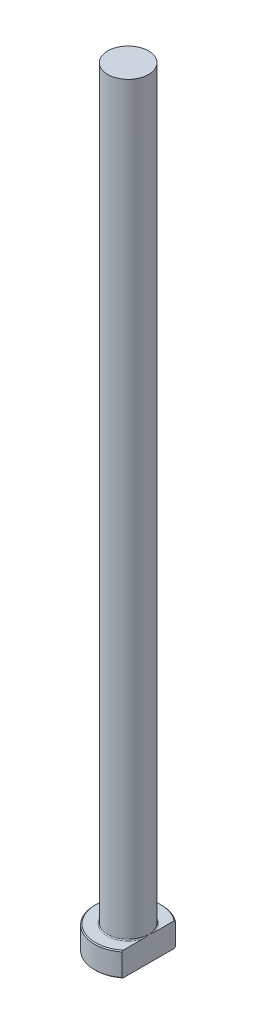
ISO-10303-21;
HEADER;
FILE_DESCRIPTION(('STEP AP214'),'2;1');
FILE_NAME('part.step','',(''),(''),'','','');
FILE_SCHEMA(('AUTOMOTIVE_DESIGN { 1 0 10303 214 1 1 1 1 }'));
ENDSEC;
DATA;
#1=APPLICATION_CONTEXT('core data for automotive mechanical design processes');
#2=APPLICATION_PROTOCOL_DEFINITION('international standard','automotive_design',2000,#1);
#3=PRODUCT_CONTEXT('',#1,'mechanical');
#4=PRODUCT('Part','Part','',(#3));
#5=PRODUCT_RELATED_PRODUCT_CATEGORY('part','',(#4));
#6=PRODUCT_DEFINITION_FORMATION('','',#4);
#7=PRODUCT_DEFINITION_CONTEXT('part definition',#1,'design');
#8=PRODUCT_DEFINITION('design','',#6,#7);
#9=PRODUCT_DEFINITION_SHAPE('','',#8);
#10=(LENGTH_UNIT() NAMED_UNIT(*) SI_UNIT(.MILLI.,.METRE.));
#11=(NAMED_UNIT(*) PLANE_ANGLE_UNIT() SI_UNIT($,.RADIAN.));
#12=(NAMED_UNIT(*) SI_UNIT($,.STERADIAN.) SOLID_ANGLE_UNIT());
#13=UNCERTAINTY_MEASURE_WITH_UNIT(LENGTH_MEASURE(1.E-05),#10,'distance_accuracy_value','');
#14=(GEOMETRIC_REPRESENTATION_CONTEXT(3) GLOBAL_UNCERTAINTY_ASSIGNED_CONTEXT((#13)) GLOBAL_UNIT_ASSIGNED_CONTEXT((#10,
#11,#12)) REPRESENTATION_CONTEXT('',''));
#15=CARTESIAN_POINT('',(0.,0.,0.));
#16=DIRECTION('',(0.,0.,1.));
#17=DIRECTION('',(1.,0.,0.));
#18=AXIS2_PLACEMENT_3D('',#15,#16,#17);
#19=CARTESIAN_POINT('',(0.,0.,0.));
#20=DIRECTION('',(0.,-1.,0.));
#21=DIRECTION('',(0.,0.,-1.));
#22=AXIS2_PLACEMENT_3D('',#19,#20,#21);
#23=PLANE('',#22);
#24=CARTESIAN_POINT('',(0.,0.,0.));
#25=DIRECTION('',(0.,-1.,0.));
#26=DIRECTION('',(0.,0.,-1.));
#27=AXIS2_PLACEMENT_3D('',#24,#25,#26);
#28=CIRCLE('',#27,6.79999999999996);
#29=CARTESIAN_POINT('',(4.24999999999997,0.,5.30824829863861));
#30=VERTEX_POINT('',#29);
#31=CARTESIAN_POINT('',(4.24999999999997,0.,-5.30824829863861));
#32=VERTEX_POINT('',#31);
#33=EDGE_CURVE('E98',#30,#32,#28,.T.);
#34=ORIENTED_EDGE('',*,*,#33,.T.);
#35=DIRECTION('',(0.,0.,1.));
#36=VECTOR('',#35,1.);
#37=CARTESIAN_POINT('',(4.24999999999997,0.,-5.56214886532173));
#38=LINE('',#37,#36);
#39=EDGE_CURVE('E83',#32,#30,#38,.T.);
#40=ORIENTED_EDGE('',*,*,#39,.T.);
#41=EDGE_LOOP('',(#34,#40));
#42=FACE_BOUND('',#41,.T.);
#43=ADVANCED_FACE('F32',(#42),#23,.T.);
#44=CARTESIAN_POINT('',(0.,259.958771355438,0.));
#45=DIRECTION('',(0.,1.,0.));
#46=DIRECTION('',(0.,0.,1.));
#47=AXIS2_PLACEMENT_3D('',#44,#45,#46);
#48=CYLINDRICAL_SURFACE('',#47,6.99999999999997);
#49=CARTESIAN_POINT('',(0.,4.80000000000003,0.));
#50=DIRECTION('',(0.,1.,0.));
#51=DIRECTION('',(0.,0.,1.));
#52=AXIS2_PLACEMENT_3D('',#49,#50,#51);
#53=CIRCLE('',#52,6.99999999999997);
#54=CARTESIAN_POINT('',(4.24999999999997,4.80000000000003,5.56214886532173));
#55=VERTEX_POINT('',#54);
#56=CARTESIAN_POINT('',(4.24999999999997,4.80000000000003,-5.56214886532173));
#57=VERTEX_POINT('',#56);
#58=EDGE_CURVE('E104',#55,#57,#53,.F.);
#59=ORIENTED_EDGE('',*,*,#58,.T.);
#60=DIRECTION('',(0.,-1.,0.));
#61=VECTOR('',#60,1.);
#62=CARTESIAN_POINT('',(4.24999999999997,160.,-5.56214886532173));
#63=LINE('',#62,#61);
#64=CARTESIAN_POINT('',(4.24999999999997,0.200000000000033,-5.56214886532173));
#65=VERTEX_POINT('',#64);
#66=EDGE_CURVE('E183',#57,#65,#63,.T.);
#67=ORIENTED_EDGE('',*,*,#66,.T.);
#68=CARTESIAN_POINT('',(0.,0.200000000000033,0.));
#69=DIRECTION('',(0.,-1.,0.));
#70=DIRECTION('',(0.,0.,-1.));
#71=AXIS2_PLACEMENT_3D('',#68,#69,#70);
#72=CIRCLE('',#71,6.99999999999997);
#73=CARTESIAN_POINT('',(4.24999999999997,0.200000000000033,5.56214886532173));
#74=VERTEX_POINT('',#73);
#75=EDGE_CURVE('E100',#65,#74,#72,.F.);
#76=ORIENTED_EDGE('',*,*,#75,.T.);
#77=DIRECTION('',(0.,-1.,0.));
#78=VECTOR('',#77,1.);
#79=CARTESIAN_POINT('',(4.24999999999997,160.,5.56214886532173));
#80=LINE('',#79,#78);
#81=EDGE_CURVE('E93',#55,#74,#80,.T.);
#82=ORIENTED_EDGE('',*,*,#81,.F.);
#83=EDGE_LOOP('',(#59,#67,#76,#82));
#84=FACE_BOUND('',#83,.T.);
#85=ADVANCED_FACE('F158',(#84),#48,.T.);
#86=CARTESIAN_POINT('',(-6.99999999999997,5.,0.));
#87=DIRECTION('',(0.,1.,0.));
#88=DIRECTION('',(0.,0.,1.));
#89=AXIS2_PLACEMENT_3D('',#86,#87,#88);
#90=PLANE('',#89);
#91=CARTESIAN_POINT('',(0.,5.,0.));
#92=DIRECTION('',(0.,1.,0.));
#93=DIRECTION('',(0.,0.,1.));
#94=AXIS2_PLACEMENT_3D('',#91,#92,#93);
#95=CIRCLE('',#94,6.80000000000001);
#96=CARTESIAN_POINT('',(4.24999999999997,5.,-5.30824829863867));
#97=VERTEX_POINT('',#96);
#98=CARTESIAN_POINT('',(4.24999999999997,5.,5.30824829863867));
#99=VERTEX_POINT('',#98);
#100=EDGE_CURVE('E178',#97,#99,#95,.T.);
#101=ORIENTED_EDGE('',*,*,#100,.T.);
#102=DIRECTION('',(0.,0.,-1.));
#103=VECTOR('',#102,1.);
#104=CARTESIAN_POINT('',(4.24999999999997,5.,0.));
#105=LINE('',#104,#103);
#106=CARTESIAN_POINT('',(4.24999999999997,4.99999999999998,1.31909059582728));
#107=VERTEX_POINT('',#106);
#108=EDGE_CURVE('E57',#99,#107,#105,.T.);
#109=ORIENTED_EDGE('',*,*,#108,.T.);
#110=CARTESIAN_POINT('',(0.,5.,0.));
#111=DIRECTION('',(0.,1.,0.));
#112=DIRECTION('',(0.,0.,1.));
#113=AXIS2_PLACEMENT_3D('',#110,#111,#112);
#114=CIRCLE('',#113,4.44999999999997);
#115=CARTESIAN_POINT('',(4.24999999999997,4.99999999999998,-1.31909059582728));
#116=VERTEX_POINT('',#115);
#117=EDGE_CURVE('E107',#107,#116,#114,.F.);
#118=ORIENTED_EDGE('',*,*,#117,.T.);
#119=EDGE_CURVE('E136',#116,#97,#105,.T.);
#120=ORIENTED_EDGE('',*,*,#119,.T.);
#121=EDGE_LOOP('',(#101,#109,#118,#120));
#122=FACE_BOUND('',#121,.T.);
#123=ADVANCED_FACE('F147',(#122),#90,.T.);
#124=CARTESIAN_POINT('',(0.,5.,0.));
#125=DIRECTION('',(0.,-1.,0.));
#126=DIRECTION('',(0.,0.,-1.));
#127=AXIS2_PLACEMENT_3D('',#124,#125,#126);
#128=CONICAL_SURFACE('',#127,6.8,0.785398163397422);
#129=ORIENTED_EDGE('',*,*,#58,.F.);
#130=CARTESIAN_POINT('',(4.24999999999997,-1.15497179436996,12.2380061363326));
#131=CARTESIAN_POINT('',(4.24999999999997,-0.968600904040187,12.0407126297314));
#132=CARTESIAN_POINT('',(4.24999999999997,-0.782481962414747,11.843180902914));
#133=CARTESIAN_POINT('',(4.24999999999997,-0.41083559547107,11.4475596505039));
#134=CARTESIAN_POINT('',(4.24999999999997,-0.225308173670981,11.2494701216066));
#135=CARTESIAN_POINT('',(4.24999999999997,0.330615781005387,10.6538566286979));
#136=CARTESIAN_POINT('',(4.24999999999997,0.699987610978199,10.2553749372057));
#137=CARTESIAN_POINT('',(4.24999999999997,1.44820689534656,9.44056382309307));
#138=CARTESIAN_POINT('',(4.24999999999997,1.82691721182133,9.02410803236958));
#139=CARTESIAN_POINT('',(4.24999999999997,2.39038838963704,8.39564122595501));
#140=CARTESIAN_POINT('',(4.24999999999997,2.57736390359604,8.18561642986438));
#141=CARTESIAN_POINT('',(4.24999999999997,2.94948531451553,7.76395344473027));
#142=CARTESIAN_POINT('',(4.24999999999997,3.13463122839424,7.55231527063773));
#143=CARTESIAN_POINT('',(4.24999999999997,3.50243810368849,7.12729701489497));
#144=CARTESIAN_POINT('',(4.24999999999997,3.68510158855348,6.91391912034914));
#145=CARTESIAN_POINT('',(4.24999999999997,4.04753998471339,6.48470257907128));
#146=CARTESIAN_POINT('',(4.24999999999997,4.227314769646,6.26886382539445));
#147=CARTESIAN_POINT('',(4.24999999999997,4.58362310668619,5.83346482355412));
#148=CARTESIAN_POINT('',(4.24999999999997,4.76014565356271,5.61389554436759));
#149=CARTESIAN_POINT('',(4.24999999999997,5.10813954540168,5.17081545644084));
#150=CARTESIAN_POINT('',(4.24999999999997,5.27961153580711,4.94730515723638));
#151=CARTESIAN_POINT('',(4.24999999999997,5.61292794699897,4.49883470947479));
#152=CARTESIAN_POINT('',(4.24999999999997,5.77488381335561,4.2739577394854));
#153=CARTESIAN_POINT('',(4.24999999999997,6.08959034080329,3.8175542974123));
#154=CARTESIAN_POINT('',(4.24999999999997,6.24233528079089,3.58602382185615));
#155=CARTESIAN_POINT('',(4.24999999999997,6.46088242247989,3.23296927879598));
#156=CARTESIAN_POINT('',(4.24999999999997,6.5318099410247,3.11461948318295));
#157=CARTESIAN_POINT('',(4.24999999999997,6.66953191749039,2.87554671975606));
#158=CARTESIAN_POINT('',(4.24999999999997,6.73632692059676,2.75482406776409));
#159=CARTESIAN_POINT('',(4.24999999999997,6.8648005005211,2.51086229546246));
#160=CARTESIAN_POINT('',(4.24999999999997,6.92648531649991,2.38762647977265));
#161=CARTESIAN_POINT('',(4.24999999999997,7.04367856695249,2.13827051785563));
#162=CARTESIAN_POINT('',(4.24999999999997,7.09918867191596,2.0121511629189));
#163=CARTESIAN_POINT('',(4.24999999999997,7.20212054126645,1.75821381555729));
#164=CARTESIAN_POINT('',(4.24999999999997,7.24962333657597,1.63042897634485));
#165=CARTESIAN_POINT('',(4.24999999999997,7.33574687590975,1.37182854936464));
#166=CARTESIAN_POINT('',(4.24999999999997,7.37436534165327,1.24101219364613));
#167=CARTESIAN_POINT('',(4.24999999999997,7.44090399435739,0.977431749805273));
#168=CARTESIAN_POINT('',(4.24999999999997,7.46888314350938,0.844682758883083));
#169=CARTESIAN_POINT('',(4.24999999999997,7.513008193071,0.577216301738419));
#170=CARTESIAN_POINT('',(4.24999999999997,7.52915548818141,0.44249906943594));
#171=CARTESIAN_POINT('',(4.24999999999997,7.54874331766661,0.170860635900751));
#172=CARTESIAN_POINT('',(4.24999999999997,7.55206380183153,0.0339306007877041));
#173=CARTESIAN_POINT('',(4.24999999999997,7.54544836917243,-0.239598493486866));
#174=CARTESIAN_POINT('',(4.24999999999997,7.53551276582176,-0.376197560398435));
#175=CARTESIAN_POINT('',(4.24999999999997,7.50295253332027,-0.648437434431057));
#176=CARTESIAN_POINT('',(4.24999999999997,7.48027427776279,-0.784071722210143));
#177=CARTESIAN_POINT('',(4.24999999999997,7.42348982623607,-1.05291460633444));
#178=CARTESIAN_POINT('',(4.24999999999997,7.38938084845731,-1.18612260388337));
#179=CARTESIAN_POINT('',(4.24999999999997,7.29188531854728,-1.51531404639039));
#180=CARTESIAN_POINT('',(4.24999999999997,7.22238075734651,-1.70947814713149));
#181=CARTESIAN_POINT('',(4.24999999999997,7.06668741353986,-2.09097599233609));
#182=CARTESIAN_POINT('',(4.24999999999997,6.98048657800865,-2.27830468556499));
#183=CARTESIAN_POINT('',(4.24999999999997,6.8414947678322,-2.55552751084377));
#184=CARTESIAN_POINT('',(4.24999999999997,6.79327931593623,-2.64776502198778));
#185=CARTESIAN_POINT('',(4.24999999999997,6.69413480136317,-2.83077431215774));
#186=CARTESIAN_POINT('',(4.24999999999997,6.64320570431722,-2.92154607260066));
#187=CARTESIAN_POINT('',(4.24999999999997,6.53904474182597,-3.10170103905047));
#188=CARTESIAN_POINT('',(4.24999999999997,6.48581387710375,-3.1910848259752));
#189=CARTESIAN_POINT('',(4.24999999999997,6.37734720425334,-3.368618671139));
#190=CARTESIAN_POINT('',(4.24999999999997,6.32211148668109,-3.45676878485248));
#191=CARTESIAN_POINT('',(4.24999999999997,6.13027123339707,-3.75631659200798));
#192=CARTESIAN_POINT('',(4.24999999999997,5.98947006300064,-3.96503082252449));
#193=CARTESIAN_POINT('',(4.24999999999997,5.70061349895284,-4.37739745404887));
#194=CARTESIAN_POINT('',(4.24999999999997,5.55255625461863,-4.58104854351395));
#195=CARTESIAN_POINT('',(4.24999999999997,5.25096308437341,-4.98451036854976));
#196=CARTESIAN_POINT('',(4.24999999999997,5.09742258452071,-5.1843176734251));
#197=CARTESIAN_POINT('',(4.24999999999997,4.78630665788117,-5.58072220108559));
#198=CARTESIAN_POINT('',(4.24999999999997,4.62873161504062,-5.77731972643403));
#199=CARTESIAN_POINT('',(4.24999999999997,4.30987074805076,-6.1686662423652));
#200=CARTESIAN_POINT('',(4.24999999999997,4.14857352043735,-6.36340591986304));
#201=CARTESIAN_POINT('',(4.24999999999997,3.82349048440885,-6.75079948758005));
#202=CARTESIAN_POINT('',(4.24999999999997,3.65970462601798,-6.94345333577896));
#203=CARTESIAN_POINT('',(4.24999999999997,3.33022176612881,-7.32695469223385));
#204=CARTESIAN_POINT('',(4.24999999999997,3.16452573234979,-7.51780303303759));
#205=CARTESIAN_POINT('',(4.24999999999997,2.83151234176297,-7.89808083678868));
#206=CARTESIAN_POINT('',(4.24999999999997,2.66419497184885,-8.08751028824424));
#207=CARTESIAN_POINT('',(4.24999999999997,2.1967456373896,-8.61299836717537));
#208=CARTESIAN_POINT('',(4.24999999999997,1.89516668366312,-8.94776953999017));
#209=CARTESIAN_POINT('',(4.24999999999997,1.28890266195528,-9.6145639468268));
#210=CARTESIAN_POINT('',(4.24999999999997,0.984217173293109,-9.94658679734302));
#211=CARTESIAN_POINT('',(4.24999999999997,0.374739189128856,-10.6061264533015));
#212=CARTESIAN_POINT('',(4.24999999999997,0.0699631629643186,-10.9336584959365));
#213=CARTESIAN_POINT('',(4.24999999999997,-0.541317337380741,-11.5870007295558));
#214=CARTESIAN_POINT('',(4.24999999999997,-0.847821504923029,-11.9128112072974));
#215=CARTESIAN_POINT('',(4.24999999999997,-1.15497179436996,-12.2380061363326));
#216=B_SPLINE_CURVE_WITH_KNOTS('',3,(#130,#131,#132,#133,#134,#135,#136,#137,#138,#139,#140,
#141,#142,#143,#144,#145,#146,#147,#148,#149,#150,#151,#152,#153,#154,#155,#156,#157,#158,#159,
#160,#161,#162,#163,#164,#165,#166,#167,#168,#169,#170,#171,#172,#173,#174,#175,#176,#177,#178,
#179,#180,#181,#182,#183,#184,#185,#186,#187,#188,#189,#190,#191,#192,#193,#194,#195,#196,#197,
#198,#199,#200,#201,#202,#203,#204,#205,#206,#207,#208,#209,#210,#211,#212,#213,#214,#215),
.UNSPECIFIED.,.F.,.F.,(4,2,2,2,2,2,2,2,2,2,2,2,2,2,2,2,2,2,2,2,2,2,2,2,2,2,2,2,2,2,2,2,2,2,2,2,
2,2,2,2,2,2,4),(0.,0.814204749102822,1.62841433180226,3.25843263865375,4.94708916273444,
5.79066412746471,6.63423128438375,7.47686481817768,8.31953511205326,9.16466757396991,
10.0096915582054,10.8409260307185,11.6726715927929,12.0865355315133,12.500344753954,
12.9136410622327,13.3268252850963,13.7355380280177,14.1443554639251,14.5508730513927,
14.9573427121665,15.3676075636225,15.777862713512,16.1898574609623,16.6019525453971,
17.2195383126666,17.8375715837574,18.1497730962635,18.461978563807,18.7740496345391,
19.0861066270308,19.8411596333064,20.5964062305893,21.3522982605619,22.1081186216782,
22.8666854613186,23.6252675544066,24.3834808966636,25.141700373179,26.4934084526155,
27.845302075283,29.1874909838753,30.5294487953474),.UNSPECIFIED.);
#217=EDGE_CURVE('E135',#55,#99,#216,.T.);
#218=ORIENTED_EDGE('',*,*,#217,.T.);
#219=ORIENTED_EDGE('',*,*,#100,.F.);
#220=EDGE_CURVE('E127',#97,#57,#216,.T.);
#221=ORIENTED_EDGE('',*,*,#220,.T.);
#222=EDGE_LOOP('',(#129,#218,#219,#221));
#223=FACE_BOUND('',#222,.T.);
#224=ADVANCED_FACE('F143',(#223),#128,.T.);
#225=CARTESIAN_POINT('',(0.,0.200000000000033,0.));
#226=DIRECTION('',(0.,1.,0.));
#227=DIRECTION('',(0.,0.,1.));
#228=AXIS2_PLACEMENT_3D('',#225,#226,#227);
#229=CONICAL_SURFACE('',#228,6.99999999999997,0.785398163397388);
#230=ORIENTED_EDGE('',*,*,#75,.F.);
#231=CARTESIAN_POINT('',(4.24999999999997,6.15497179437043,-12.2380061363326));
#232=CARTESIAN_POINT('',(4.24999999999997,5.96860090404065,-12.0407126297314));
#233=CARTESIAN_POINT('',(4.24999999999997,5.7824819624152,-11.843180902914));
#234=CARTESIAN_POINT('',(4.24999999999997,5.4108355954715,-11.4475596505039));
#235=CARTESIAN_POINT('',(4.24999999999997,5.22530817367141,-11.2494701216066));
#236=CARTESIAN_POINT('',(4.24999999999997,4.66938421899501,-10.6538566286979));
#237=CARTESIAN_POINT('',(4.24999999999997,4.30001238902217,-10.2553749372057));
#238=CARTESIAN_POINT('',(4.24999999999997,3.55179310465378,-9.44056382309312));
#239=CARTESIAN_POINT('',(4.24999999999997,3.17308278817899,-9.02410803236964));
#240=CARTESIAN_POINT('',(4.24999999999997,2.60961161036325,-8.39564122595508));
#241=CARTESIAN_POINT('',(4.24999999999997,2.42263609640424,-8.18561642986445));
#242=CARTESIAN_POINT('',(4.24999999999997,2.05051468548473,-7.76395344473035));
#243=CARTESIAN_POINT('',(4.24999999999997,1.86536877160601,-7.55231527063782));
#244=CARTESIAN_POINT('',(4.24999999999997,1.49756189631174,-7.12729701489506));
#245=CARTESIAN_POINT('',(4.24999999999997,1.31489841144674,-6.91391912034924));
#246=CARTESIAN_POINT('',(4.24999999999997,0.95246001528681,-6.48470257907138));
#247=CARTESIAN_POINT('',(4.24999999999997,0.772685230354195,-6.26886382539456));
#248=CARTESIAN_POINT('',(4.24999999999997,0.416376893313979,-5.83346482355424));
#249=CARTESIAN_POINT('',(4.24999999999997,0.239854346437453,-5.61389554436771));
#250=CARTESIAN_POINT('',(4.24999999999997,-0.108139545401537,-5.17081545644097));
#251=CARTESIAN_POINT('',(4.24999999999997,-0.279611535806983,-4.94730515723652));
#252=CARTESIAN_POINT('',(4.24999999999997,-0.61292794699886,-4.49883470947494));
#253=CARTESIAN_POINT('',(4.24999999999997,-0.774883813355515,-4.27395773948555));
#254=CARTESIAN_POINT('',(4.24999999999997,-1.08959034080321,-3.81755429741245));
#255=CARTESIAN_POINT('',(4.24999999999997,-1.24233528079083,-3.58602382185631));
#256=CARTESIAN_POINT('',(4.24999999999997,-1.46088242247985,-3.23296927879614));
#257=CARTESIAN_POINT('',(4.24999999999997,-1.53180994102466,-3.11461948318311));
#258=CARTESIAN_POINT('',(4.24999999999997,-1.66953191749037,-2.87554671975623));
#259=CARTESIAN_POINT('',(4.24999999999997,-1.73632692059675,-2.75482406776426));
#260=CARTESIAN_POINT('',(4.24999999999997,-1.86480050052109,-2.51086229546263));
#261=CARTESIAN_POINT('',(4.24999999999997,-1.92648531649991,-2.38762647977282));
#262=CARTESIAN_POINT('',(4.24999999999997,-2.04367856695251,-2.1382705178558));
#263=CARTESIAN_POINT('',(4.24999999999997,-2.09918867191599,-2.01215116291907));
#264=CARTESIAN_POINT('',(4.24999999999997,-2.20212054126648,-1.75821381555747));
#265=CARTESIAN_POINT('',(4.24999999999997,-2.24962333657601,-1.63042897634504));
#266=CARTESIAN_POINT('',(4.24999999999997,-2.33574687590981,-1.37182854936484));
#267=CARTESIAN_POINT('',(4.24999999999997,-2.37436534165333,-1.24101219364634));
#268=CARTESIAN_POINT('',(4.24999999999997,-2.44090399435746,-0.977431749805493));
#269=CARTESIAN_POINT('',(4.24999999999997,-2.46888314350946,-0.84468275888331));
#270=CARTESIAN_POINT('',(4.24999999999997,-2.51300819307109,-0.57721630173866));
#271=CARTESIAN_POINT('',(4.24999999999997,-2.52915548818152,-0.442499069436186));
#272=CARTESIAN_POINT('',(4.24999999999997,-2.54874331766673,-0.170860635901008));
#273=CARTESIAN_POINT('',(4.24999999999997,-2.55206380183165,-0.0339306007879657));
#274=CARTESIAN_POINT('',(4.24999999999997,-2.54544836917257,0.239598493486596));
#275=CARTESIAN_POINT('',(4.24999999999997,-2.53551276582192,0.376197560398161));
#276=CARTESIAN_POINT('',(4.24999999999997,-2.50295253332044,0.648437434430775));
#277=CARTESIAN_POINT('',(4.24999999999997,-2.48027427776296,0.784071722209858));
#278=CARTESIAN_POINT('',(4.24999999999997,-2.42348982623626,1.05291460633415));
#279=CARTESIAN_POINT('',(4.24999999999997,-2.38938084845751,1.18612260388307));
#280=CARTESIAN_POINT('',(4.24999999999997,-2.29188531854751,1.51531404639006));
#281=CARTESIAN_POINT('',(4.24999999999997,-2.22238075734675,1.70947814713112));
#282=CARTESIAN_POINT('',(4.24999999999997,-2.06668741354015,2.09097599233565));
#283=CARTESIAN_POINT('',(4.24999999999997,-1.98048657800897,2.27830468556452));
#284=CARTESIAN_POINT('',(4.24999999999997,-1.84149476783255,2.55552751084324));
#285=CARTESIAN_POINT('',(4.24999999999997,-1.79327931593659,2.64776502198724));
#286=CARTESIAN_POINT('',(4.24999999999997,-1.69413480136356,2.83077431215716));
#287=CARTESIAN_POINT('',(4.24999999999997,-1.64320570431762,2.92154607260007));
#288=CARTESIAN_POINT('',(4.24999999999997,-1.5390447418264,3.10170103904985));
#289=CARTESIAN_POINT('',(4.24999999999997,-1.48581387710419,3.19108482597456));
#290=CARTESIAN_POINT('',(4.24999999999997,-1.37734720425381,3.36861867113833));
#291=CARTESIAN_POINT('',(4.24999999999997,-1.32211148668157,3.45676878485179));
#292=CARTESIAN_POINT('',(4.24999999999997,-1.13027123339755,3.7563165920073));
#293=CARTESIAN_POINT('',(4.24999999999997,-0.989470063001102,3.96503082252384));
#294=CARTESIAN_POINT('',(4.24999999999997,-0.700613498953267,4.37739745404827));
#295=CARTESIAN_POINT('',(4.24999999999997,-0.552556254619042,4.58104854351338));
#296=CARTESIAN_POINT('',(4.24999999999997,-0.250963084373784,4.98451036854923));
#297=CARTESIAN_POINT('',(4.24999999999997,-0.097422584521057,5.1843176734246));
#298=CARTESIAN_POINT('',(4.24999999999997,0.213693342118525,5.58072220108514));
#299=CARTESIAN_POINT('',(4.24999999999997,0.371268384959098,5.7773197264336));
#300=CARTESIAN_POINT('',(4.24999999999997,0.690129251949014,6.16866624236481));
#301=CARTESIAN_POINT('',(4.24999999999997,0.851426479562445,6.36340591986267));
#302=CARTESIAN_POINT('',(4.24999999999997,1.176509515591,6.75079948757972));
#303=CARTESIAN_POINT('',(4.24999999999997,1.3402953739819,6.94345333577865));
#304=CARTESIAN_POINT('',(4.24999999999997,1.66977823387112,7.32695469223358));
#305=CARTESIAN_POINT('',(4.24999999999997,1.83547426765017,7.51780303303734));
#306=CARTESIAN_POINT('',(4.24999999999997,2.16848765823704,7.89808083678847));
#307=CARTESIAN_POINT('',(4.24999999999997,2.33580502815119,8.08751028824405));
#308=CARTESIAN_POINT('',(4.24999999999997,2.8032543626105,8.61299836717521));
#309=CARTESIAN_POINT('',(4.24999999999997,3.10483331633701,8.94776953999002));
#310=CARTESIAN_POINT('',(4.24999999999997,3.71109733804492,9.61456394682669));
#311=CARTESIAN_POINT('',(4.24999999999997,4.01578282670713,9.94658679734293));
#312=CARTESIAN_POINT('',(4.24999999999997,4.62526081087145,10.6061264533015));
#313=CARTESIAN_POINT('',(4.24999999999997,4.93003683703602,10.9336584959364));
#314=CARTESIAN_POINT('',(4.24999999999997,5.54131733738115,11.5870007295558));
#315=CARTESIAN_POINT('',(4.24999999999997,5.84782150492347,11.9128112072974));
#316=CARTESIAN_POINT('',(4.24999999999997,6.15497179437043,12.2380061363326));
#317=B_SPLINE_CURVE_WITH_KNOTS('',3,(#231,#232,#233,#234,#235,#236,#237,#238,#239,#240,#241,
#242,#243,#244,#245,#246,#247,#248,#249,#250,#251,#252,#253,#254,#255,#256,#257,#258,#259,#260,
#261,#262,#263,#264,#265,#266,#267,#268,#269,#270,#271,#272,#273,#274,#275,#276,#277,#278,#279,
#280,#281,#282,#283,#284,#285,#286,#287,#288,#289,#290,#291,#292,#293,#294,#295,#296,#297,#298,
#299,#300,#301,#302,#303,#304,#305,#306,#307,#308,#309,#310,#311,#312,#313,#314,#315,#316),
.UNSPECIFIED.,.F.,.F.,(4,2,2,2,2,2,2,2,2,2,2,2,2,2,2,2,2,2,2,2,2,2,2,2,2,2,2,2,2,2,2,2,2,2,2,2,
2,2,2,2,2,2,4),(0.,0.814204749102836,1.62841433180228,3.2584326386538,4.94708916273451,
5.7906641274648,6.63423128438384,7.47686481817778,8.31953511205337,9.16466757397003,
10.0096915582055,10.8409260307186,11.672671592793,12.0865355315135,12.5003447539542,
12.9136410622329,13.3268252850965,13.7355380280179,14.1443554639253,14.5508730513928,
14.9573427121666,15.3676075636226,15.7778627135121,16.1898574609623,16.6019525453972,
17.2195383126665,17.8375715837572,18.1497730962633,18.4619785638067,18.7740496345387,
19.0861066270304,19.8411596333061,20.5964062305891,21.3522982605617,22.1081186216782,
22.8666854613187,23.6252675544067,24.3834808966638,25.1417003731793,26.493408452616,
27.8453020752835,29.187490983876,30.5294487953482),.UNSPECIFIED.);
#318=EDGE_CURVE('E86',#65,#32,#317,.T.);
#319=ORIENTED_EDGE('',*,*,#318,.T.);
#320=ORIENTED_EDGE('',*,*,#33,.F.);
#321=EDGE_CURVE('E89',#30,#74,#317,.T.);
#322=ORIENTED_EDGE('',*,*,#321,.T.);
#323=EDGE_LOOP('',(#230,#319,#320,#322));
#324=FACE_BOUND('',#323,.T.);
#325=ADVANCED_FACE('F97',(#324),#229,.T.);
#326=CARTESIAN_POINT('',(0.,5.19999999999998,0.));
#327=DIRECTION('',(0.,1.,0.));
#328=DIRECTION('',(0.,0.,1.));
#329=AXIS2_PLACEMENT_3D('',#326,#327,#328);
#330=TOROIDAL_SURFACE('',#329,4.44999999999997,0.2);
#331=CARTESIAN_POINT('',(4.24999999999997,5.19999999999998,0.));
#332=CARTESIAN_POINT('',(4.24999999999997,5.20000051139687,1.15744821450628E-10));
#333=CARTESIAN_POINT('',(4.24999999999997,5.20000102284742,-2.4293169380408E-07));
#334=CARTESIAN_POINT('',(4.24999999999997,5.20000197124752,-8.87321860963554E-07));
#335=CARTESIAN_POINT('',(4.24999999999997,5.20000238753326,-1.30614850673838E-06));
#336=CARTESIAN_POINT('',(4.24999999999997,5.20000327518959,-2.31752643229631E-06));
#337=CARTESIAN_POINT('',(4.24999999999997,5.20000373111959,-2.92646131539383E-06));
#338=CARTESIAN_POINT('',(4.24999999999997,5.200004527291,-4.16981951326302E-06));
#339=CARTESIAN_POINT('',(4.24999999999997,5.2000048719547,-4.80170872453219E-06));
#340=CARTESIAN_POINT('',(4.24999999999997,5.20000620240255,-7.3194814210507E-06));
#341=CARTESIAN_POINT('',(4.24999999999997,5.20000712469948,-9.24257745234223E-06));
#342=CARTESIAN_POINT('',(4.24999999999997,5.20000859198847,-1.29952261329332E-05));
#343=CARTESIAN_POINT('',(4.24999999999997,5.20000916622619,-1.48137375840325E-05));
#344=CARTESIAN_POINT('',(4.24999999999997,5.20001166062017,-2.2701068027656E-05));
#345=CARTESIAN_POINT('',(4.24999999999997,5.20001358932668,-2.87689532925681E-05));
#346=CARTESIAN_POINT('',(4.24999999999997,5.20001634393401,-4.00958698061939E-05));
#347=CARTESIAN_POINT('',(4.24999999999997,5.20001729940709,-4.53228601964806E-05));
#348=CARTESIAN_POINT('',(4.24999999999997,5.20002438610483,-8.47086375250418E-05));
#349=CARTESIAN_POINT('',(4.24999999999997,5.20002990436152,-0.000118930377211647));
#350=CARTESIAN_POINT('',(4.24999999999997,5.20005405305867,-0.000255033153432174));
#351=CARTESIAN_POINT('',(4.24999999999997,5.20007694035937,-0.00035616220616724));
#352=CARTESIAN_POINT('',(4.24999999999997,5.20016675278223,-0.000759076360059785));
#353=CARTESIAN_POINT('',(4.24999999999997,5.20023104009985,-0.00106124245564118));
#354=CARTESIAN_POINT('',(4.24999999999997,5.20048990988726,-0.00226975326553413));
#355=CARTESIAN_POINT('',(4.24999999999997,5.20068789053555,-0.00317558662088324));
#356=CARTESIAN_POINT('',(4.24999999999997,5.20151472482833,-0.00696787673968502));
#357=CARTESIAN_POINT('',(4.24999999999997,5.2021393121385,-0.00985497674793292));
#358=CARTESIAN_POINT('',(4.24999999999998,5.21047485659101,-0.0483744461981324));
#359=CARTESIAN_POINT('',(4.24999999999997,5.21821166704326,-0.0840032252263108));
#360=CARTESIAN_POINT('',(4.24999999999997,5.23443934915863,-0.15925743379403));
#361=CARTESIAN_POINT('',(4.24999999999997,5.24291807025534,-0.198885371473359));
#362=CARTESIAN_POINT('',(4.24999999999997,5.25719269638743,-0.266483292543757));
#363=CARTESIAN_POINT('',(4.24999999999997,5.2630418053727,-0.294441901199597));
#364=CARTESIAN_POINT('',(4.24999999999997,5.27443459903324,-0.349631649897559));
#365=CARTESIAN_POINT('',(4.24999999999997,5.27998226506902,-0.37686197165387));
#366=CARTESIAN_POINT('',(4.24999999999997,5.29789349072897,-0.466265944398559));
#367=CARTESIAN_POINT('',(4.24999999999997,5.3098841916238,-0.528515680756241));
#368=CARTESIAN_POINT('',(4.24999999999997,5.33255488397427,-0.653873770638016));
#369=CARTESIAN_POINT('',(4.24999999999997,5.34322118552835,-0.716984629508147));
#370=CARTESIAN_POINT('',(4.24999999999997,5.36341886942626,-0.849542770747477));
#371=CARTESIAN_POINT('',(4.24999999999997,5.37274606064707,-0.919022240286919));
#372=CARTESIAN_POINT('',(4.24999999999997,5.38787342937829,-1.05816998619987));
#373=CARTESIAN_POINT('',(4.24999999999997,5.39368393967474,-1.12783709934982));
#374=CARTESIAN_POINT('',(4.24999999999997,5.40022105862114,-1.26519903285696));
#375=CARTESIAN_POINT('',(4.24999999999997,5.40110718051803,-1.33288413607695));
#376=CARTESIAN_POINT('',(4.24999999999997,5.39715260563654,-1.43372383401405));
#377=CARTESIAN_POINT('',(4.24999999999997,5.39498924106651,-1.46697561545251));
#378=CARTESIAN_POINT('',(4.24999999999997,5.38843757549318,-1.53323057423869));
#379=CARTESIAN_POINT('',(4.24999999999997,5.38405165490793,-1.56623397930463));
#380=CARTESIAN_POINT('',(4.24999999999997,5.37221191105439,-1.63225744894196));
#381=CARTESIAN_POINT('',(4.24999999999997,5.36471302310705,-1.665270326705));
#382=CARTESIAN_POINT('',(4.24999999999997,5.35002141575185,-1.71373529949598));
#383=CARTESIAN_POINT('',(4.24999999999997,5.3445543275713,-1.72970598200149));
#384=CARTESIAN_POINT('',(4.24999999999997,5.33212858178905,-1.76104662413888));
#385=CARTESIAN_POINT('',(4.24999999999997,5.32517291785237,-1.77641771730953));
#386=CARTESIAN_POINT('',(4.24999999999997,5.31157493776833,-1.80173413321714));
#387=CARTESIAN_POINT('',(4.24999999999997,5.30543892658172,-1.81194868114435));
#388=CARTESIAN_POINT('',(4.24999999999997,5.29187259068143,-1.83147712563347));
#389=CARTESIAN_POINT('',(4.24999999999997,5.28444659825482,-1.84079387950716));
#390=CARTESIAN_POINT('',(4.24999999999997,5.27165788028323,-1.8539962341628));
#391=CARTESIAN_POINT('',(4.24999999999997,5.26687308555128,-1.85843752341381));
#392=CARTESIAN_POINT('',(4.24999999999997,5.25674280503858,-1.86663816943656));
#393=CARTESIAN_POINT('',(4.24999999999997,5.25139780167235,-1.87039810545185));
#394=CARTESIAN_POINT('',(4.24999999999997,5.24121545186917,-1.87633128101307));
#395=CARTESIAN_POINT('',(4.24999999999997,5.23647607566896,-1.87867040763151));
#396=CARTESIAN_POINT('',(4.24999999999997,5.22667692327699,-1.88254109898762));
#397=CARTESIAN_POINT('',(4.24999999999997,5.22161755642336,-1.88407367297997));
#398=CARTESIAN_POINT('',(4.24999999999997,5.21125115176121,-1.88618376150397));
#399=CARTESIAN_POINT('',(4.24999999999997,5.20594232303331,-1.8867527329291));
#400=CARTESIAN_POINT('',(4.24999999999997,5.1953165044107,-1.88683483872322));
#401=CARTESIAN_POINT('',(4.24999999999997,5.18999951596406,-1.88634814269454));
#402=CARTESIAN_POINT('',(4.24999999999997,5.18024254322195,-1.88451305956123));
#403=CARTESIAN_POINT('',(4.24999999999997,5.17577879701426,-1.88328567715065));
#404=CARTESIAN_POINT('',(4.24999999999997,5.16708370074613,-1.88018632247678));
#405=CARTESIAN_POINT('',(4.24999999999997,5.16285244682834,-1.87831408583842));
#406=CARTESIAN_POINT('',(4.24999999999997,5.15236530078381,-1.8728422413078));
#407=CARTESIAN_POINT('',(4.24999999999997,5.14630821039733,-1.86886321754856));
#408=CARTESIAN_POINT('',(4.24999999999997,5.13488065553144,-1.8600173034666));
#409=CARTESIAN_POINT('',(4.24999999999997,5.12951236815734,-1.85514771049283));
#410=CARTESIAN_POINT('',(4.24999999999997,5.11550691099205,-1.84083719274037));
#411=CARTESIAN_POINT('',(4.24999999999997,5.10752788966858,-1.83075903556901));
#412=CARTESIAN_POINT('',(4.24999999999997,5.09305704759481,-1.80961650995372));
#413=CARTESIAN_POINT('',(4.24999999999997,5.08656786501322,-1.7985504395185));
#414=CARTESIAN_POINT('',(4.24999999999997,5.07270261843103,-1.77195183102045));
#415=CARTESIAN_POINT('',(4.24999999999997,5.06578110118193,-1.75618509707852));
#416=CARTESIAN_POINT('',(4.24999999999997,5.05343494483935,-1.72406513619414));
#417=CARTESIAN_POINT('',(4.24999999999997,5.04801326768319,-1.70771081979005));
#418=CARTESIAN_POINT('',(4.24999999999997,5.03828568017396,-1.67446840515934));
#419=CARTESIAN_POINT('',(4.24999999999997,5.03399373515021,-1.65757628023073));
#420=CARTESIAN_POINT('',(4.24999999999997,5.02638165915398,-1.62359857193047));
#421=CARTESIAN_POINT('',(4.24999999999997,5.02306049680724,-1.60651321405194));
#422=CARTESIAN_POINT('',(4.24999999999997,5.01554103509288,-1.56237813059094));
#423=CARTESIAN_POINT('',(4.24999999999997,5.01193061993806,-1.53522860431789));
#424=CARTESIAN_POINT('',(4.24999999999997,5.00624732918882,-1.48076491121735));
#425=CARTESIAN_POINT('',(4.24999999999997,5.00417529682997,-1.45345066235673));
#426=CARTESIAN_POINT('',(4.24999999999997,4.99980704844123,-1.37123328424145));
#427=CARTESIAN_POINT('',(4.24999999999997,4.99938405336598,-1.31623108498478));
#428=CARTESIAN_POINT('',(4.24999999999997,5.00195512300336,-1.20937484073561));
#429=CARTESIAN_POINT('',(4.24999999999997,5.00476235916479,-1.15751417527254));
#430=CARTESIAN_POINT('',(4.24999999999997,5.01274020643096,-1.05395255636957));
#431=CARTESIAN_POINT('',(4.24999999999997,5.0179120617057,-1.00225170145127));
#432=CARTESIAN_POINT('',(4.24999999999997,5.0318667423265,-0.883772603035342));
#433=CARTESIAN_POINT('',(4.24999999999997,5.04126554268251,-0.817068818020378));
#434=CARTESIAN_POINT('',(4.24999999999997,5.06248695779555,-0.68230638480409));
#435=CARTESIAN_POINT('',(4.24999999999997,5.0743654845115,-0.614256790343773));
#436=CARTESIAN_POINT('',(4.24999999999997,5.09582131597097,-0.499048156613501));
#437=CARTESIAN_POINT('',(4.24999999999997,5.10500357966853,-0.451814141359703));
#438=CARTESIAN_POINT('',(4.24999999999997,5.1237965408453,-0.357991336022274));
#439=CARTESIAN_POINT('',(4.24999999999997,5.13340116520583,-0.311401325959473));
#440=CARTESIAN_POINT('',(4.24999999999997,5.15180561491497,-0.223687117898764));
#441=CARTESIAN_POINT('',(4.24999999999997,5.16056968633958,-0.182555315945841));
#442=CARTESIAN_POINT('',(4.24999999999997,5.178640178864,-0.0985301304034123));
#443=CARTESIAN_POINT('',(4.24999999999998,5.18795357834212,-0.0556381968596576));
#444=CARTESIAN_POINT('',(4.24999999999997,5.1978622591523,-0.00984762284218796));
#445=CARTESIAN_POINT('',(4.24999999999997,5.19848844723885,-0.00695317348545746));
#446=CARTESIAN_POINT('',(4.24999999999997,5.1993156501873,-0.00315924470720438));
#447=CARTESIAN_POINT('',(4.24999999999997,5.19951238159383,-0.00225911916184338));
#448=CARTESIAN_POINT('',(4.24999999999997,5.19976973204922,-0.00105770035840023));
#449=CARTESIAN_POINT('',(4.24999999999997,5.19983372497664,-0.000756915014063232));
#450=CARTESIAN_POINT('',(4.24999999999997,5.19992318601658,-0.000355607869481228));
#451=CARTESIAN_POINT('',(4.24999999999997,5.19994602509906,-0.000254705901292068));
#452=CARTESIAN_POINT('',(4.24999999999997,5.1999701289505,-0.000118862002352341));
#453=CARTESIAN_POINT('',(4.24999999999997,5.19997564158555,-8.4670569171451E-05));
#454=CARTESIAN_POINT('',(4.24999999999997,5.19998271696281,-4.53159337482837E-05));
#455=CARTESIAN_POINT('',(4.24999999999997,5.19998367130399,-4.00904844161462E-05));
#456=CARTESIAN_POINT('',(4.24999999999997,5.19998642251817,-2.87668536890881E-05));
#457=CARTESIAN_POINT('',(4.24999999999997,5.19998834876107,-2.27006335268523E-05));
#458=CARTESIAN_POINT('',(4.24999999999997,5.19999084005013,-1.48150638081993E-05));
#459=CARTESIAN_POINT('',(4.24999999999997,5.199991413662,-1.29966656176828E-05));
#460=CARTESIAN_POINT('',(4.24999999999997,5.19999287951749,-9.24415318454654E-06));
#461=CARTESIAN_POINT('',(4.24999999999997,5.19999380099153,-7.32106390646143E-06));
#462=CARTESIAN_POINT('',(4.24999999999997,5.19999513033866,-4.8031966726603E-06));
#463=CARTESIAN_POINT('',(4.24999999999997,5.19999547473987,-4.17124743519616E-06));
#464=CARTESIAN_POINT('',(4.24999999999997,5.19999627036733,-2.92772184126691E-06));
#465=CARTESIAN_POINT('',(4.24999999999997,5.19999672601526,-2.31867707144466E-06));
#466=CARTESIAN_POINT('',(4.24999999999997,5.19999761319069,-1.30704757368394E-06));
#467=CARTESIAN_POINT('',(4.24999999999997,5.19999802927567,-8.88090030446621E-07));
#468=CARTESIAN_POINT('',(4.24999999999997,5.19999897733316,-2.43359811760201E-07));
#469=CARTESIAN_POINT('',(4.24999999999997,5.19999948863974,-1.15736528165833E-10));
#470=CARTESIAN_POINT('',(4.24999999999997,5.19999999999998,0.));
#471=B_SPLINE_CURVE_WITH_KNOTS('',3,(#331,#332,#333,#334,#335,#336,#337,#338,#339,#340,#341,
#342,#343,#344,#345,#346,#347,#348,#349,#350,#351,#352,#353,#354,#355,#356,#357,#358,#359,#360,
#361,#362,#363,#364,#365,#366,#367,#368,#369,#370,#371,#372,#373,#374,#375,#376,#377,#378,#379,
#380,#381,#382,#383,#384,#385,#386,#387,#388,#389,#390,#391,#392,#393,#394,#395,#396,#397,#398,
#399,#400,#401,#402,#403,#404,#405,#406,#407,#408,#409,#410,#411,#412,#413,#414,#415,#416,#417,
#418,#419,#420,#421,#422,#423,#424,#425,#426,#427,#428,#429,#430,#431,#432,#433,#434,#435,#436,
#437,#438,#439,#440,#441,#442,#443,#444,#445,#446,#447,#448,#449,#450,#451,#452,#453,#454,#455,
#456,#457,#458,#459,#460,#461,#462,#463,#464,#465,#466,#467,#468,#469,#470),.UNSPECIFIED.,.T.,
.F.,(4,2,2,2,2,2,2,2,2,2,2,2,2,2,2,2,2,2,2,2,2,2,2,2,2,2,2,2,2,2,2,2,2,2,2,2,2,2,2,2,2,2,2,2,2,
2,2,2,2,2,2,2,2,2,2,2,2,2,2,2,2,2,2,2,2,2,2,2,2,4),(0.,1.56348638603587E-06,
3.34736003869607E-06,5.61252474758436E-06,7.7714730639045E-06,1.41498338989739E-05,
1.98654803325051E-05,3.89412506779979E-05,5.48646730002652E-05,0.000158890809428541,
0.000469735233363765,0.00139675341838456,0.00417812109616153,0.0130401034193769,
0.122414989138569,0.243989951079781,0.329681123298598,0.413050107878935,0.603220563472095,
0.795216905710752,1.00545960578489,1.21508152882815,1.41787186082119,1.51777979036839,
1.61758094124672,1.71888023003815,1.76947366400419,1.81996629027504,1.85565144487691,
1.89121899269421,1.91076085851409,1.93028603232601,1.94608264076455,1.9618594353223,
1.97777538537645,1.99368877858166,2.00752120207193,2.02135930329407,2.04297559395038,
2.06465860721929,2.10300421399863,2.14141720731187,2.19295510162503,2.24459405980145,
2.29684419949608,2.34903862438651,2.43114134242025,2.51328903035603,2.67811431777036,
2.83386590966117,2.98969954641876,3.19173551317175,3.39894587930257,3.54329728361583,
3.68600406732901,3.81216982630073,3.94384090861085,3.95272545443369,3.9554892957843,
3.9564120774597,3.95672222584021,3.95682615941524,3.95684207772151,3.95686114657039,
3.95686686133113,3.9568732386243,3.95687539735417,3.95687766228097,3.95687944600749,
3.95688100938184),.UNSPECIFIED.);
#472=CARTESIAN_POINT('',(4.24999999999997,5.19999999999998,0.));
#473=VERTEX_POINT('',#472);
#474=EDGE_CURVE('E11',#116,#473,#471,.T.);
#475=ORIENTED_EDGE('',*,*,#474,.F.);
#476=ORIENTED_EDGE('',*,*,#117,.F.);
#477=CARTESIAN_POINT('',(4.24999999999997,5.19999999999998,0.));
#478=CARTESIAN_POINT('',(4.24999999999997,5.1999994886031,-1.15744598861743E-10));
#479=CARTESIAN_POINT('',(4.24999999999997,5.19999897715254,2.42931693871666E-07));
#480=CARTESIAN_POINT('',(4.24999999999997,5.19999802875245,8.87321860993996E-07));
#481=CARTESIAN_POINT('',(4.24999999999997,5.1999976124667,1.30614850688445E-06));
#482=CARTESIAN_POINT('',(4.24999999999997,5.19999672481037,2.31752643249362E-06));
#483=CARTESIAN_POINT('',(4.24999999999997,5.19999626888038,2.92646131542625E-06));
#484=CARTESIAN_POINT('',(4.24999999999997,5.19999547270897,4.16981951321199E-06));
#485=CARTESIAN_POINT('',(4.24999999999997,5.19999512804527,4.8017087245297E-06));
#486=CARTESIAN_POINT('',(4.24999999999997,5.19999379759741,7.31948142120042E-06));
#487=CARTESIAN_POINT('',(4.24999999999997,5.19999287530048,9.24257745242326E-06));
#488=CARTESIAN_POINT('',(4.24999999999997,5.1999914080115,1.29952261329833E-05));
#489=CARTESIAN_POINT('',(4.24999999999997,5.19999083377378,1.48137375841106E-05));
#490=CARTESIAN_POINT('',(4.24999999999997,5.19998833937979,2.27010680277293E-05));
#491=CARTESIAN_POINT('',(4.24999999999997,5.19998641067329,2.87689532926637E-05));
#492=CARTESIAN_POINT('',(4.24999999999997,5.19998365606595,4.00958698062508E-05));
#493=CARTESIAN_POINT('',(4.24999999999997,5.19998270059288,4.53228601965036E-05));
#494=CARTESIAN_POINT('',(4.24999999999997,5.19997561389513,8.47086375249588E-05));
#495=CARTESIAN_POINT('',(4.24999999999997,5.19997009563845,0.000118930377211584));
#496=CARTESIAN_POINT('',(4.24999999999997,5.19994594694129,0.000255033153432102));
#497=CARTESIAN_POINT('',(4.24999999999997,5.1999230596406,0.000356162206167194));
#498=CARTESIAN_POINT('',(4.24999999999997,5.19983324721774,0.000759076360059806));
#499=CARTESIAN_POINT('',(4.24999999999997,5.19976895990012,0.00106124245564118));
#500=CARTESIAN_POINT('',(4.24999999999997,5.19951009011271,0.00226975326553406));
#501=CARTESIAN_POINT('',(4.24999999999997,5.19931210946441,0.00317558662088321));
#502=CARTESIAN_POINT('',(4.24999999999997,5.19848527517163,0.00696787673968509));
#503=CARTESIAN_POINT('',(4.24999999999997,5.19786068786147,0.00985497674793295));
#504=CARTESIAN_POINT('',(4.24999999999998,5.18952514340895,0.0483744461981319));
#505=CARTESIAN_POINT('',(4.24999999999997,5.1817883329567,0.0840032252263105));
#506=CARTESIAN_POINT('',(4.24999999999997,5.16556065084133,0.15925743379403));
#507=CARTESIAN_POINT('',(4.24999999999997,5.15708192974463,0.198885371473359));
#508=CARTESIAN_POINT('',(4.24999999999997,5.14280730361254,0.266483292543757));
#509=CARTESIAN_POINT('',(4.24999999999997,5.13695819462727,0.294441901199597));
#510=CARTESIAN_POINT('',(4.24999999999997,5.12556540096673,0.349631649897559));
#511=CARTESIAN_POINT('',(4.24999999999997,5.12001773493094,0.37686197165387));
#512=CARTESIAN_POINT('',(4.24999999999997,5.10210650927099,0.466265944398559));
#513=CARTESIAN_POINT('',(4.24999999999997,5.09011580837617,0.528515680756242));
#514=CARTESIAN_POINT('',(4.24999999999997,5.0674451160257,0.653873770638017));
#515=CARTESIAN_POINT('',(4.24999999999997,5.05677881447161,0.716984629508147));
#516=CARTESIAN_POINT('',(4.24999999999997,5.0365811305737,0.849542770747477));
#517=CARTESIAN_POINT('',(4.24999999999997,5.0272539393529,0.919022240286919));
#518=CARTESIAN_POINT('',(4.24999999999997,5.01212657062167,1.05816998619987));
#519=CARTESIAN_POINT('',(4.24999999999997,5.00631606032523,1.12783709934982));
#520=CARTESIAN_POINT('',(4.24999999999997,4.99977894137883,1.26519903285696));
#521=CARTESIAN_POINT('',(4.24999999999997,4.99889281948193,1.33288413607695));
#522=CARTESIAN_POINT('',(4.24999999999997,5.00284739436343,1.43372383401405));
#523=CARTESIAN_POINT('',(4.24999999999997,5.00501075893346,1.46697561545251));
#524=CARTESIAN_POINT('',(4.24999999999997,5.01156242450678,1.53323057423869));
#525=CARTESIAN_POINT('',(4.24999999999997,5.01594834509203,1.56623397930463));
#526=CARTESIAN_POINT('',(4.24999999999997,5.02778808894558,1.63225744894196));
#527=CARTESIAN_POINT('',(4.24999999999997,5.03528697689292,1.665270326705));
#528=CARTESIAN_POINT('',(4.24999999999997,5.04997858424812,1.71373529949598));
#529=CARTESIAN_POINT('',(4.24999999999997,5.05544567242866,1.72970598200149));
#530=CARTESIAN_POINT('',(4.24999999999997,5.06787141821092,1.76104662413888));
#531=CARTESIAN_POINT('',(4.24999999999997,5.0748270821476,1.77641771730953));
#532=CARTESIAN_POINT('',(4.24999999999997,5.08842506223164,1.80173413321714));
#533=CARTESIAN_POINT('',(4.24999999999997,5.09456107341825,1.81194868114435));
#534=CARTESIAN_POINT('',(4.24999999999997,5.10812740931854,1.83147712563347));
#535=CARTESIAN_POINT('',(4.24999999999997,5.11555340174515,1.84079387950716));
#536=CARTESIAN_POINT('',(4.24999999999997,5.12834211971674,1.8539962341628));
#537=CARTESIAN_POINT('',(4.24999999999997,5.13312691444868,1.85843752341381));
#538=CARTESIAN_POINT('',(4.24999999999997,5.14325719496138,1.86663816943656));
#539=CARTESIAN_POINT('',(4.24999999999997,5.14860219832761,1.87039810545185));
#540=CARTESIAN_POINT('',(4.24999999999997,5.15878454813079,1.87633128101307));
#541=CARTESIAN_POINT('',(4.24999999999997,5.16352392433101,1.87867040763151));
#542=CARTESIAN_POINT('',(4.24999999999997,5.17332307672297,1.88254109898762));
#543=CARTESIAN_POINT('',(4.24999999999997,5.17838244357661,1.88407367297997));
#544=CARTESIAN_POINT('',(4.24999999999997,5.18874884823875,1.88618376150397));
#545=CARTESIAN_POINT('',(4.24999999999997,5.19405767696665,1.8867527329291));
#546=CARTESIAN_POINT('',(4.24999999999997,5.20468349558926,1.88683483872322));
#547=CARTESIAN_POINT('',(4.24999999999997,5.2100004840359,1.88634814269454));
#548=CARTESIAN_POINT('',(4.24999999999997,5.21975745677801,1.88451305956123));
#549=CARTESIAN_POINT('',(4.24999999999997,5.2242212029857,1.88328567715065));
#550=CARTESIAN_POINT('',(4.24999999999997,5.23291629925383,1.88018632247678));
#551=CARTESIAN_POINT('',(4.24999999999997,5.23714755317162,1.87831408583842));
#552=CARTESIAN_POINT('',(4.24999999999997,5.24763469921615,1.8728422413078));
#553=CARTESIAN_POINT('',(4.24999999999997,5.25369178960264,1.86886321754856));
#554=CARTESIAN_POINT('',(4.24999999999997,5.26511934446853,1.8600173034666));
#555=CARTESIAN_POINT('',(4.24999999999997,5.27048763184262,1.85514771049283));
#556=CARTESIAN_POINT('',(4.24999999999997,5.28449308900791,1.84083719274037));
#557=CARTESIAN_POINT('',(4.24999999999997,5.29247211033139,1.83075903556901));
#558=CARTESIAN_POINT('',(4.24999999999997,5.30694295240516,1.80961650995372));
#559=CARTESIAN_POINT('',(4.24999999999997,5.31343213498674,1.7985504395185));
#560=CARTESIAN_POINT('',(4.24999999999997,5.32729738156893,1.77195183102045));
#561=CARTESIAN_POINT('',(4.24999999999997,5.33421889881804,1.75618509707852));
#562=CARTESIAN_POINT('',(4.24999999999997,5.34656505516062,1.72406513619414));
#563=CARTESIAN_POINT('',(4.24999999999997,5.35198673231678,1.70771081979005));
#564=CARTESIAN_POINT('',(4.24999999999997,5.361714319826,1.67446840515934));
#565=CARTESIAN_POINT('',(4.24999999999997,5.36600626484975,1.65757628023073));
#566=CARTESIAN_POINT('',(4.24999999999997,5.37361834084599,1.62359857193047));
#567=CARTESIAN_POINT('',(4.24999999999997,5.37693950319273,1.60651321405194));
#568=CARTESIAN_POINT('',(4.24999999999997,5.38445896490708,1.56237813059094));
#569=CARTESIAN_POINT('',(4.24999999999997,5.38806938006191,1.53522860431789));
#570=CARTESIAN_POINT('',(4.24999999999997,5.39375267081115,1.48076491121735));
#571=CARTESIAN_POINT('',(4.24999999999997,5.39582470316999,1.45345066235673));
#572=CARTESIAN_POINT('',(4.24999999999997,5.40019295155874,1.37123328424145));
#573=CARTESIAN_POINT('',(4.24999999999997,5.40061594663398,1.31623108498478));
#574=CARTESIAN_POINT('',(4.24999999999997,5.3980448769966,1.20937484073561));
#575=CARTESIAN_POINT('',(4.24999999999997,5.39523764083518,1.15751417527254));
#576=CARTESIAN_POINT('',(4.24999999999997,5.387259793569,1.05395255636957));
#577=CARTESIAN_POINT('',(4.24999999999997,5.38208793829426,1.00225170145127));
#578=CARTESIAN_POINT('',(4.24999999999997,5.36813325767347,0.883772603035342));
#579=CARTESIAN_POINT('',(4.24999999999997,5.35873445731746,0.817068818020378));
#580=CARTESIAN_POINT('',(4.24999999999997,5.33751304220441,0.68230638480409));
#581=CARTESIAN_POINT('',(4.24999999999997,5.32563451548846,0.614256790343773));
#582=CARTESIAN_POINT('',(4.24999999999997,5.304178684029,0.499048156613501));
#583=CARTESIAN_POINT('',(4.24999999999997,5.29499642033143,0.451814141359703));
#584=CARTESIAN_POINT('',(4.24999999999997,5.27620345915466,0.357991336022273));
#585=CARTESIAN_POINT('',(4.24999999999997,5.26659883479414,0.311401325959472));
#586=CARTESIAN_POINT('',(4.24999999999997,5.248194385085,0.223687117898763));
#587=CARTESIAN_POINT('',(4.24999999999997,5.23943031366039,0.182555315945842));
#588=CARTESIAN_POINT('',(4.24999999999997,5.22135982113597,0.0985301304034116));
#589=CARTESIAN_POINT('',(4.24999999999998,5.21204642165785,0.0556381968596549));
#590=CARTESIAN_POINT('',(4.24999999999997,5.20213774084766,0.00984762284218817));
#591=CARTESIAN_POINT('',(4.24999999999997,5.20151155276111,0.00695317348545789));
#592=CARTESIAN_POINT('',(4.24999999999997,5.20068434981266,0.00315924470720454));
#593=CARTESIAN_POINT('',(4.24999999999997,5.20048761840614,0.00225911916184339));
#594=CARTESIAN_POINT('',(4.24999999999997,5.20023026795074,0.00105770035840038));
#595=CARTESIAN_POINT('',(4.24999999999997,5.20016627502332,0.000756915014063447));
#596=CARTESIAN_POINT('',(4.24999999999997,5.20007681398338,0.00035560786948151));
#597=CARTESIAN_POINT('',(4.24999999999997,5.20005397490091,0.000254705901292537));
#598=CARTESIAN_POINT('',(4.24999999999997,5.20002987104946,0.000118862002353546));
#599=CARTESIAN_POINT('',(4.24999999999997,5.20002435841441,8.467056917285E-05));
#600=CARTESIAN_POINT('',(4.24999999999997,5.20001728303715,4.53159337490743E-05));
#601=CARTESIAN_POINT('',(4.24999999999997,5.20001632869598,4.00904844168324E-05));
#602=CARTESIAN_POINT('',(4.24999999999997,5.2000135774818,2.87668536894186E-05));
#603=CARTESIAN_POINT('',(4.24999999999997,5.20001165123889,2.27006335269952E-05));
#604=CARTESIAN_POINT('',(4.24999999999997,5.20000915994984,1.48150638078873E-05));
#605=CARTESIAN_POINT('',(4.24999999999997,5.20000858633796,1.29966656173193E-05));
#606=CARTESIAN_POINT('',(4.24999999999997,5.20000712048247,9.24415318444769E-06));
#607=CARTESIAN_POINT('',(4.24999999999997,5.20000619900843,7.3210639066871E-06));
#608=CARTESIAN_POINT('',(4.24999999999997,5.20000486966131,4.80319667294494E-06));
#609=CARTESIAN_POINT('',(4.24999999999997,5.20000452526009,4.17124743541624E-06));
#610=CARTESIAN_POINT('',(4.24999999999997,5.20000372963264,2.92772184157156E-06));
#611=CARTESIAN_POINT('',(4.24999999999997,5.20000327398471,2.31867707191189E-06));
#612=CARTESIAN_POINT('',(4.24999999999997,5.20000238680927,1.30704757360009E-06));
#613=CARTESIAN_POINT('',(4.24999999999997,5.2000019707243,8.88090029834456E-07));
#614=CARTESIAN_POINT('',(4.24999999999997,5.20000102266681,2.43359811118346E-07));
#615=CARTESIAN_POINT('',(4.24999999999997,5.20000051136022,1.15736305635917E-10));
#616=CARTESIAN_POINT('',(4.24999999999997,5.19999999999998,0.));
#617=B_SPLINE_CURVE_WITH_KNOTS('',3,(#477,#478,#479,#480,#481,#482,#483,#484,#485,#486,#487,
#488,#489,#490,#491,#492,#493,#494,#495,#496,#497,#498,#499,#500,#501,#502,#503,#504,#505,#506,
#507,#508,#509,#510,#511,#512,#513,#514,#515,#516,#517,#518,#519,#520,#521,#522,#523,#524,#525,
#526,#527,#528,#529,#530,#531,#532,#533,#534,#535,#536,#537,#538,#539,#540,#541,#542,#543,#544,
#545,#546,#547,#548,#549,#550,#551,#552,#553,#554,#555,#556,#557,#558,#559,#560,#561,#562,#563,
#564,#565,#566,#567,#568,#569,#570,#571,#572,#573,#574,#575,#576,#577,#578,#579,#580,#581,#582,
#583,#584,#585,#586,#587,#588,#589,#590,#591,#592,#593,#594,#595,#596,#597,#598,#599,#600,#601,
#602,#603,#604,#605,#606,#607,#608,#609,#610,#611,#612,#613,#614,#615,#616),.UNSPECIFIED.,.T.,
.F.,(4,2,2,2,2,2,2,2,2,2,2,2,2,2,2,2,2,2,2,2,2,2,2,2,2,2,2,2,2,2,2,2,2,2,2,2,2,2,2,2,2,2,2,2,2,
2,2,2,2,2,2,2,2,2,2,2,2,2,2,2,2,2,2,2,2,2,2,2,2,4),(0.,1.56348638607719E-06,3.3473600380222E-06,
5.61252474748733E-06,7.77147306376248E-06,1.41498338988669E-05,1.9865480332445E-05,
3.89412506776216E-05,5.48646729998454E-05,0.000158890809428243,0.000469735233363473,
0.00139675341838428,0.00417812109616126,0.0130401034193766,0.122414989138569,0.243989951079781,
0.329681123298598,0.413050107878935,0.603220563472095,0.795216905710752,1.00545960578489,
1.21508152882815,1.41787186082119,1.51777979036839,1.61758094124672,1.71888023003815,
1.76947366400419,1.81996629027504,1.85565144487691,1.89121899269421,1.91076085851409,
1.93028603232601,1.94608264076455,1.9618594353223,1.97777538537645,1.99368877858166,
2.00752120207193,2.02135930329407,2.04297559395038,2.06465860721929,2.10300421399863,
2.14141720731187,2.19295510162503,2.24459405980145,2.29684419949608,2.34903862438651,
2.43114134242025,2.51328903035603,2.67811431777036,2.83386590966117,2.98969954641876,
3.19173551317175,3.39894587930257,3.54329728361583,3.68600406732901,3.81216982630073,
3.94384090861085,3.95272545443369,3.9554892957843,3.9564120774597,3.95672222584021,
3.95682615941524,3.95684207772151,3.95686114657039,3.95686686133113,3.9568732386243,
3.95687539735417,3.95687766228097,3.95687944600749,3.95688100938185),.UNSPECIFIED.);
#618=EDGE_CURVE('E46',#473,#107,#617,.T.);
#619=ORIENTED_EDGE('',*,*,#618,.F.);
#620=CARTESIAN_POINT('',(0.,5.19999999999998,0.));
#621=DIRECTION('',(0.,1.,0.));
#622=DIRECTION('',(0.,0.,1.));
#623=AXIS2_PLACEMENT_3D('',#620,#621,#622);
#624=CIRCLE('',#623,4.24999999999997);
#625=EDGE_CURVE('E103',#473,#473,#624,.T.);
#626=ORIENTED_EDGE('',*,*,#625,.F.);
#627=EDGE_LOOP('',(#475,#476,#619,#626));
#628=FACE_BOUND('',#627,.T.);
#629=ADVANCED_FACE('F34',(#628),#330,.F.);
#630=CARTESIAN_POINT('',(0.,259.958771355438,0.));
#631=DIRECTION('',(0.,1.,0.));
#632=DIRECTION('',(0.,0.,1.));
#633=AXIS2_PLACEMENT_3D('',#630,#631,#632);
#634=CYLINDRICAL_SURFACE('',#633,4.24999999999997);
#635=ORIENTED_EDGE('',*,*,#625,.T.);
#636=EDGE_LOOP('',(#635));
#637=FACE_BOUND('',#636,.T.);
#638=CARTESIAN_POINT('',(0.,160.,0.));
#639=DIRECTION('',(0.,1.,0.));
#640=DIRECTION('',(0.,0.,1.));
#641=AXIS2_PLACEMENT_3D('',#638,#639,#640);
#642=CIRCLE('',#641,4.24999999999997);
#643=CARTESIAN_POINT('',(0.,160.,4.24999999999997));
#644=VERTEX_POINT('',#643);
#645=EDGE_CURVE('E101',#644,#644,#642,.T.);
#646=ORIENTED_EDGE('',*,*,#645,.F.);
#647=EDGE_LOOP('',(#646));
#648=FACE_BOUND('',#647,.T.);
#649=ADVANCED_FACE('F155',(#637,#648),#634,.T.);
#650=CARTESIAN_POINT('',(-4.24999999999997,160.,0.));
#651=DIRECTION('',(0.,1.,0.));
#652=DIRECTION('',(0.,0.,1.));
#653=AXIS2_PLACEMENT_3D('',#650,#651,#652);
#654=PLANE('',#653);
#655=ORIENTED_EDGE('',*,*,#645,.T.);
#656=EDGE_LOOP('',(#655));
#657=FACE_BOUND('',#656,.T.);
#658=ADVANCED_FACE('F121',(#657),#654,.T.);
#659=CARTESIAN_POINT('',(4.24999999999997,160.,-5.56214886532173));
#660=DIRECTION('',(1.,0.,0.));
#661=DIRECTION('',(0.,0.,-1.));
#662=AXIS2_PLACEMENT_3D('',#659,#660,#661);
#663=PLANE('',#662);
#664=ORIENTED_EDGE('',*,*,#66,.F.);
#665=ORIENTED_EDGE('',*,*,#220,.F.);
#666=ORIENTED_EDGE('',*,*,#119,.F.);
#667=ORIENTED_EDGE('',*,*,#474,.T.);
#668=ORIENTED_EDGE('',*,*,#618,.T.);
#669=ORIENTED_EDGE('',*,*,#108,.F.);
#670=ORIENTED_EDGE('',*,*,#217,.F.);
#671=ORIENTED_EDGE('',*,*,#81,.T.);
#672=ORIENTED_EDGE('',*,*,#321,.F.);
#673=ORIENTED_EDGE('',*,*,#39,.F.);
#674=ORIENTED_EDGE('',*,*,#318,.F.);
#675=EDGE_LOOP('',(#664,#665,#666,#667,#668,#669,#670,#671,#672,#673,#674));
#676=FACE_BOUND('',#675,.T.);
#677=ADVANCED_FACE('F85',(#676),#663,.T.);
#678=CLOSED_SHELL('',(#43,#85,#123,#224,#325,#629,#649,#658,#677));
#679=MANIFOLD_SOLID_BREP('B2',#678);
#680=ADVANCED_BREP_SHAPE_REPRESENTATION('',(#18,#679),#14);
#681=SHAPE_DEFINITION_REPRESENTATION(#9,#680);
ENDSEC;
END-ISO-10303-21;
